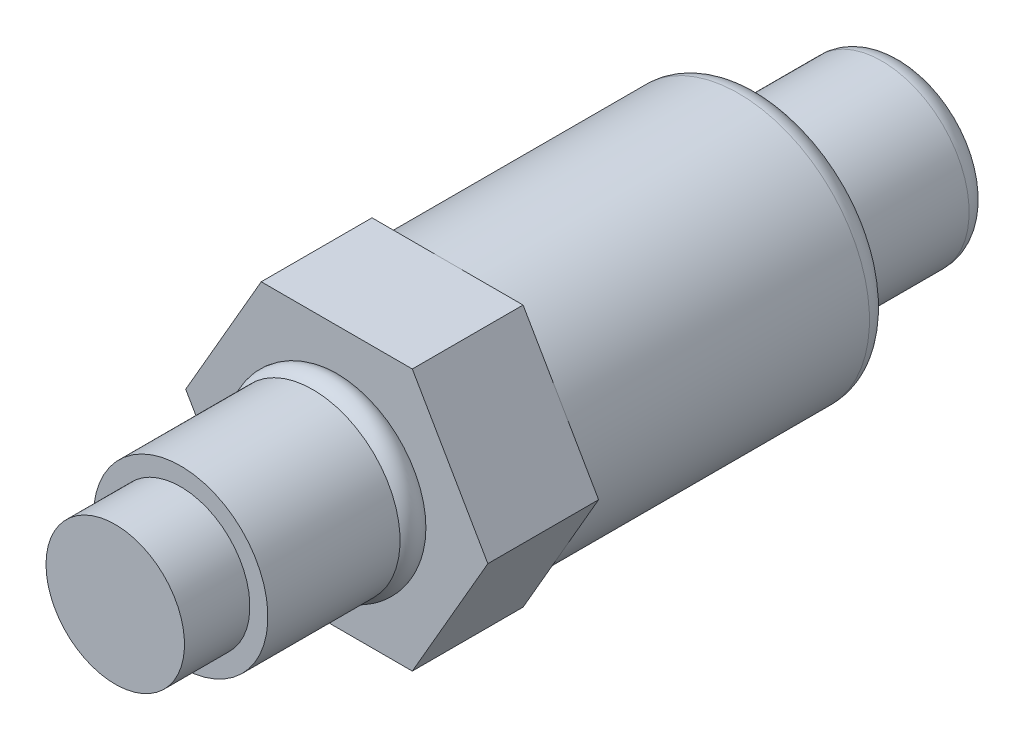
ISO-10303-21;
HEADER;
FILE_DESCRIPTION(('STEP AP214'),'2;1');
FILE_NAME('part.step','',(''),(''),'','','');
FILE_SCHEMA(('AUTOMOTIVE_DESIGN { 1 0 10303 214 1 1 1 1 }'));
ENDSEC;
DATA;
#1=APPLICATION_CONTEXT('core data for automotive mechanical design processes');
#2=APPLICATION_PROTOCOL_DEFINITION('international standard','automotive_design',2000,#1);
#3=PRODUCT_CONTEXT('',#1,'mechanical');
#4=PRODUCT('Part','Part','',(#3));
#5=PRODUCT_RELATED_PRODUCT_CATEGORY('part','',(#4));
#6=PRODUCT_DEFINITION_FORMATION('','',#4);
#7=PRODUCT_DEFINITION_CONTEXT('part definition',#1,'design');
#8=PRODUCT_DEFINITION('design','',#6,#7);
#9=PRODUCT_DEFINITION_SHAPE('','',#8);
#10=(LENGTH_UNIT() NAMED_UNIT(*) SI_UNIT(.MILLI.,.METRE.));
#11=(NAMED_UNIT(*) PLANE_ANGLE_UNIT() SI_UNIT($,.RADIAN.));
#12=(NAMED_UNIT(*) SI_UNIT($,.STERADIAN.) SOLID_ANGLE_UNIT());
#13=UNCERTAINTY_MEASURE_WITH_UNIT(LENGTH_MEASURE(1.E-05),#10,'distance_accuracy_value','');
#14=(GEOMETRIC_REPRESENTATION_CONTEXT(3) GLOBAL_UNCERTAINTY_ASSIGNED_CONTEXT((#13)) GLOBAL_UNIT_ASSIGNED_CONTEXT((#10,
#11,#12)) REPRESENTATION_CONTEXT('',''));
#15=CARTESIAN_POINT('',(0.,0.,0.));
#16=DIRECTION('',(0.,0.,1.));
#17=DIRECTION('',(1.,0.,0.));
#18=AXIS2_PLACEMENT_3D('',#15,#16,#17);
#19=CARTESIAN_POINT('',(0.,0.,14.35));
#20=DIRECTION('',(0.,0.,1.));
#21=DIRECTION('',(1.,0.,0.));
#22=AXIS2_PLACEMENT_3D('',#19,#20,#21);
#23=PLANE('',#22);
#24=CARTESIAN_POINT('',(0.,0.,14.35));
#25=DIRECTION('',(0.,0.,-1.));
#26=DIRECTION('',(-1.,0.,0.));
#27=AXIS2_PLACEMENT_3D('',#24,#25,#26);
#28=CIRCLE('',#27,6.);
#29=CARTESIAN_POINT('',(-5.19615242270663,3.,14.35));
#30=VERTEX_POINT('',#29);
#31=CARTESIAN_POINT('',(0.,6.,14.35));
#32=VERTEX_POINT('',#31);
#33=EDGE_CURVE('E128',#30,#32,#28,.T.);
#34=ORIENTED_EDGE('',*,*,#33,.F.);
#35=DIRECTION('',(-0.5,-0.866025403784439,0.));
#36=VECTOR('',#35,1.);
#37=CARTESIAN_POINT('',(-3.46410161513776,6.,14.35));
#38=LINE('',#37,#36);
#39=CARTESIAN_POINT('',(-3.46410161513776,6.,14.35));
#40=VERTEX_POINT('',#39);
#41=EDGE_CURVE('E107',#40,#30,#38,.T.);
#42=ORIENTED_EDGE('',*,*,#41,.F.);
#43=DIRECTION('',(-1.,0.,0.));
#44=VECTOR('',#43,1.);
#45=CARTESIAN_POINT('',(3.46410161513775,6.,14.35));
#46=LINE('',#45,#44);
#47=EDGE_CURVE('E129',#32,#40,#46,.T.);
#48=ORIENTED_EDGE('',*,*,#47,.F.);
#49=EDGE_LOOP('',(#34,#42,#48));
#50=FACE_BOUND('',#49,.T.);
#51=ADVANCED_FACE('F33',(#50),#23,.F.);
#52=CARTESIAN_POINT('',(5.19615242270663,3.,14.35));
#53=VERTEX_POINT('',#52);
#54=EDGE_CURVE('E55',#32,#53,#28,.T.);
#55=ORIENTED_EDGE('',*,*,#54,.F.);
#56=CARTESIAN_POINT('',(3.46410161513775,6.,14.35));
#57=VERTEX_POINT('',#56);
#58=EDGE_CURVE('E126',#57,#32,#46,.T.);
#59=ORIENTED_EDGE('',*,*,#58,.F.);
#60=DIRECTION('',(-0.5,0.866025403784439,0.));
#61=VECTOR('',#60,1.);
#62=CARTESIAN_POINT('',(6.92820323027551,0.,14.35));
#63=LINE('',#62,#61);
#64=EDGE_CURVE('E149',#53,#57,#63,.T.);
#65=ORIENTED_EDGE('',*,*,#64,.F.);
#66=EDGE_LOOP('',(#55,#59,#65));
#67=FACE_BOUND('',#66,.T.);
#68=ADVANCED_FACE('F208',(#67),#23,.F.);
#69=CARTESIAN_POINT('',(5.19615242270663,-3.,14.35));
#70=VERTEX_POINT('',#69);
#71=EDGE_CURVE('E48',#53,#70,#28,.T.);
#72=ORIENTED_EDGE('',*,*,#71,.F.);
#73=CARTESIAN_POINT('',(6.92820323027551,0.,14.35));
#74=VERTEX_POINT('',#73);
#75=EDGE_CURVE('E151',#74,#53,#63,.T.);
#76=ORIENTED_EDGE('',*,*,#75,.F.);
#77=DIRECTION('',(0.5,0.866025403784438,0.));
#78=VECTOR('',#77,1.);
#79=CARTESIAN_POINT('',(3.46410161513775,-6.,14.35));
#80=LINE('',#79,#78);
#81=EDGE_CURVE('E150',#70,#74,#80,.T.);
#82=ORIENTED_EDGE('',*,*,#81,.F.);
#83=EDGE_LOOP('',(#72,#76,#82));
#84=FACE_BOUND('',#83,.T.);
#85=ADVANCED_FACE('F213',(#84),#23,.F.);
#86=CARTESIAN_POINT('',(0.,-6.,14.35));
#87=VERTEX_POINT('',#86);
#88=EDGE_CURVE('E140',#70,#87,#28,.T.);
#89=ORIENTED_EDGE('',*,*,#88,.F.);
#90=CARTESIAN_POINT('',(3.46410161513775,-6.,14.35));
#91=VERTEX_POINT('',#90);
#92=EDGE_CURVE('E146',#91,#70,#80,.T.);
#93=ORIENTED_EDGE('',*,*,#92,.F.);
#94=DIRECTION('',(1.,0.,0.));
#95=VECTOR('',#94,1.);
#96=CARTESIAN_POINT('',(-3.46410161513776,-6.,14.35));
#97=LINE('',#96,#95);
#98=EDGE_CURVE('E156',#87,#91,#97,.T.);
#99=ORIENTED_EDGE('',*,*,#98,.F.);
#100=EDGE_LOOP('',(#89,#93,#99));
#101=FACE_BOUND('',#100,.T.);
#102=ADVANCED_FACE('F226',(#101),#23,.F.);
#103=CARTESIAN_POINT('',(-5.19615242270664,-3.,14.35));
#104=VERTEX_POINT('',#103);
#105=EDGE_CURVE('E138',#87,#104,#28,.T.);
#106=ORIENTED_EDGE('',*,*,#105,.F.);
#107=CARTESIAN_POINT('',(-3.46410161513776,-6.,14.35));
#108=VERTEX_POINT('',#107);
#109=EDGE_CURVE('E157',#108,#87,#97,.T.);
#110=ORIENTED_EDGE('',*,*,#109,.F.);
#111=DIRECTION('',(0.5,-0.866025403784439,0.));
#112=VECTOR('',#111,1.);
#113=CARTESIAN_POINT('',(-6.92820323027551,0.,14.35));
#114=LINE('',#113,#112);
#115=EDGE_CURVE('E116',#104,#108,#114,.T.);
#116=ORIENTED_EDGE('',*,*,#115,.F.);
#117=EDGE_LOOP('',(#106,#110,#116));
#118=FACE_BOUND('',#117,.T.);
#119=ADVANCED_FACE('F218',(#118),#23,.F.);
#120=EDGE_CURVE('E122',#104,#30,#28,.T.);
#121=ORIENTED_EDGE('',*,*,#120,.F.);
#122=CARTESIAN_POINT('',(-6.92820323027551,0.,14.35));
#123=VERTEX_POINT('',#122);
#124=EDGE_CURVE('E125',#123,#104,#114,.T.);
#125=ORIENTED_EDGE('',*,*,#124,.F.);
#126=EDGE_CURVE('E111',#30,#123,#38,.T.);
#127=ORIENTED_EDGE('',*,*,#126,.F.);
#128=EDGE_LOOP('',(#121,#125,#127));
#129=FACE_BOUND('',#128,.T.);
#130=ADVANCED_FACE('F120',(#129),#23,.F.);
#131=CARTESIAN_POINT('',(3.46410161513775,-6.,14.35));
#132=DIRECTION('',(0.866025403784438,-0.5,0.));
#133=DIRECTION('',(0.5,0.866025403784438,0.));
#134=AXIS2_PLACEMENT_3D('',#131,#132,#133);
#135=PLANE('',#134);
#136=DIRECTION('',(0.5,0.866025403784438,0.));
#137=VECTOR('',#136,1.);
#138=CARTESIAN_POINT('',(3.46410161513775,-6.,19.43));
#139=LINE('',#138,#137);
#140=CARTESIAN_POINT('',(3.46410161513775,-6.,19.43));
#141=VERTEX_POINT('',#140);
#142=CARTESIAN_POINT('',(6.92820323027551,0.,19.43));
#143=VERTEX_POINT('',#142);
#144=EDGE_CURVE('E132',#141,#143,#139,.T.);
#145=ORIENTED_EDGE('',*,*,#144,.F.);
#146=DIRECTION('',(0.,0.,1.));
#147=VECTOR('',#146,1.);
#148=CARTESIAN_POINT('',(3.46410161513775,-6.,14.35));
#149=LINE('',#148,#147);
#150=EDGE_CURVE('E139',#91,#141,#149,.T.);
#151=ORIENTED_EDGE('',*,*,#150,.F.);
#152=ORIENTED_EDGE('',*,*,#92,.T.);
#153=ORIENTED_EDGE('',*,*,#81,.T.);
#154=DIRECTION('',(0.,0.,1.));
#155=VECTOR('',#154,1.);
#156=CARTESIAN_POINT('',(6.92820323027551,0.,14.35));
#157=LINE('',#156,#155);
#158=EDGE_CURVE('E160',#74,#143,#157,.T.);
#159=ORIENTED_EDGE('',*,*,#158,.T.);
#160=EDGE_LOOP('',(#145,#151,#152,#153,#159));
#161=FACE_BOUND('',#160,.T.);
#162=ADVANCED_FACE('F217',(#161),#135,.T.);
#163=CARTESIAN_POINT('',(-3.46410161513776,-6.,14.35));
#164=DIRECTION('',(0.,-1.,0.));
#165=DIRECTION('',(1.,0.,0.));
#166=AXIS2_PLACEMENT_3D('',#163,#164,#165);
#167=PLANE('',#166);
#168=DIRECTION('',(1.,0.,0.));
#169=VECTOR('',#168,1.);
#170=CARTESIAN_POINT('',(-3.46410161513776,-6.,19.43));
#171=LINE('',#170,#169);
#172=CARTESIAN_POINT('',(-3.46410161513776,-6.,19.43));
#173=VERTEX_POINT('',#172);
#174=EDGE_CURVE('E175',#173,#141,#171,.T.);
#175=ORIENTED_EDGE('',*,*,#174,.F.);
#176=DIRECTION('',(0.,0.,1.));
#177=VECTOR('',#176,1.);
#178=CARTESIAN_POINT('',(-3.46410161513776,-6.,14.35));
#179=LINE('',#178,#177);
#180=EDGE_CURVE('E141',#108,#173,#179,.T.);
#181=ORIENTED_EDGE('',*,*,#180,.F.);
#182=ORIENTED_EDGE('',*,*,#109,.T.);
#183=ORIENTED_EDGE('',*,*,#98,.T.);
#184=ORIENTED_EDGE('',*,*,#150,.T.);
#185=EDGE_LOOP('',(#175,#181,#182,#183,#184));
#186=FACE_BOUND('',#185,.T.);
#187=ADVANCED_FACE('F223',(#186),#167,.T.);
#188=CARTESIAN_POINT('',(-6.92820323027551,0.,14.35));
#189=DIRECTION('',(-0.866025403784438,-0.5,0.));
#190=DIRECTION('',(0.5,-0.866025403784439,0.));
#191=AXIS2_PLACEMENT_3D('',#188,#189,#190);
#192=PLANE('',#191);
#193=DIRECTION('',(0.5,-0.866025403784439,0.));
#194=VECTOR('',#193,1.);
#195=CARTESIAN_POINT('',(-6.92820323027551,0.,19.43));
#196=LINE('',#195,#194);
#197=CARTESIAN_POINT('',(-6.92820323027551,0.,19.43));
#198=VERTEX_POINT('',#197);
#199=EDGE_CURVE('E172',#198,#173,#196,.T.);
#200=ORIENTED_EDGE('',*,*,#199,.F.);
#201=DIRECTION('',(0.,0.,1.));
#202=VECTOR('',#201,1.);
#203=CARTESIAN_POINT('',(-6.92820323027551,0.,14.35));
#204=LINE('',#203,#202);
#205=EDGE_CURVE('E179',#123,#198,#204,.T.);
#206=ORIENTED_EDGE('',*,*,#205,.F.);
#207=ORIENTED_EDGE('',*,*,#124,.T.);
#208=ORIENTED_EDGE('',*,*,#115,.T.);
#209=ORIENTED_EDGE('',*,*,#180,.T.);
#210=EDGE_LOOP('',(#200,#206,#207,#208,#209));
#211=FACE_BOUND('',#210,.T.);
#212=ADVANCED_FACE('F241',(#211),#192,.T.);
#213=CARTESIAN_POINT('',(-3.46410161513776,6.,14.35));
#214=DIRECTION('',(-0.866025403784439,0.5,0.));
#215=DIRECTION('',(-0.5,-0.866025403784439,0.));
#216=AXIS2_PLACEMENT_3D('',#213,#214,#215);
#217=PLANE('',#216);
#218=DIRECTION('',(-0.5,-0.866025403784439,0.));
#219=VECTOR('',#218,1.);
#220=CARTESIAN_POINT('',(-3.46410161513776,6.,19.43));
#221=LINE('',#220,#219);
#222=CARTESIAN_POINT('',(-3.46410161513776,6.,19.43));
#223=VERTEX_POINT('',#222);
#224=EDGE_CURVE('E169',#223,#198,#221,.T.);
#225=ORIENTED_EDGE('',*,*,#224,.F.);
#226=DIRECTION('',(0.,0.,1.));
#227=VECTOR('',#226,1.);
#228=CARTESIAN_POINT('',(-3.46410161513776,6.,14.35));
#229=LINE('',#228,#227);
#230=EDGE_CURVE('E113',#40,#223,#229,.T.);
#231=ORIENTED_EDGE('',*,*,#230,.F.);
#232=ORIENTED_EDGE('',*,*,#41,.T.);
#233=ORIENTED_EDGE('',*,*,#126,.T.);
#234=ORIENTED_EDGE('',*,*,#205,.T.);
#235=EDGE_LOOP('',(#225,#231,#232,#233,#234));
#236=FACE_BOUND('',#235,.T.);
#237=ADVANCED_FACE('F110',(#236),#217,.T.);
#238=CARTESIAN_POINT('',(3.46410161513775,6.,14.35));
#239=DIRECTION('',(0.,1.,0.));
#240=DIRECTION('',(-1.,0.,0.));
#241=AXIS2_PLACEMENT_3D('',#238,#239,#240);
#242=PLANE('',#241);
#243=DIRECTION('',(-1.,0.,0.));
#244=VECTOR('',#243,1.);
#245=CARTESIAN_POINT('',(3.46410161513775,6.,19.43));
#246=LINE('',#245,#244);
#247=CARTESIAN_POINT('',(3.46410161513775,6.,19.43));
#248=VERTEX_POINT('',#247);
#249=EDGE_CURVE('E166',#248,#223,#246,.T.);
#250=ORIENTED_EDGE('',*,*,#249,.F.);
#251=DIRECTION('',(0.,0.,1.));
#252=VECTOR('',#251,1.);
#253=CARTESIAN_POINT('',(3.46410161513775,6.,14.35));
#254=LINE('',#253,#252);
#255=EDGE_CURVE('E182',#57,#248,#254,.T.);
#256=ORIENTED_EDGE('',*,*,#255,.F.);
#257=ORIENTED_EDGE('',*,*,#58,.T.);
#258=ORIENTED_EDGE('',*,*,#47,.T.);
#259=ORIENTED_EDGE('',*,*,#230,.T.);
#260=EDGE_LOOP('',(#250,#256,#257,#258,#259));
#261=FACE_BOUND('',#260,.T.);
#262=ADVANCED_FACE('F248',(#261),#242,.T.);
#263=CARTESIAN_POINT('',(6.92820323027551,0.,14.35));
#264=DIRECTION('',(0.866025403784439,0.5,0.));
#265=DIRECTION('',(-0.5,0.866025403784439,0.));
#266=AXIS2_PLACEMENT_3D('',#263,#264,#265);
#267=PLANE('',#266);
#268=DIRECTION('',(-0.5,0.866025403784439,0.));
#269=VECTOR('',#268,1.);
#270=CARTESIAN_POINT('',(6.92820323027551,0.,19.43));
#271=LINE('',#270,#269);
#272=EDGE_CURVE('E163',#143,#248,#271,.T.);
#273=ORIENTED_EDGE('',*,*,#272,.F.);
#274=ORIENTED_EDGE('',*,*,#158,.F.);
#275=ORIENTED_EDGE('',*,*,#75,.T.);
#276=ORIENTED_EDGE('',*,*,#64,.T.);
#277=ORIENTED_EDGE('',*,*,#255,.T.);
#278=EDGE_LOOP('',(#273,#274,#275,#276,#277));
#279=FACE_BOUND('',#278,.T.);
#280=ADVANCED_FACE('F251',(#279),#267,.T.);
#281=CARTESIAN_POINT('',(0.,0.,19.43));
#282=DIRECTION('',(0.,0.,1.));
#283=DIRECTION('',(1.,0.,0.));
#284=AXIS2_PLACEMENT_3D('',#281,#282,#283);
#285=PLANE('',#284);
#286=CARTESIAN_POINT('',(0.,0.,19.43));
#287=DIRECTION('',(0.,0.,1.));
#288=DIRECTION('',(1.,0.,0.));
#289=AXIS2_PLACEMENT_3D('',#286,#287,#288);
#290=CIRCLE('',#289,4.08860313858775);
#291=CARTESIAN_POINT('',(4.08860313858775,0.,19.43));
#292=VERTEX_POINT('',#291);
#293=EDGE_CURVE('E185',#292,#292,#290,.T.);
#294=ORIENTED_EDGE('',*,*,#293,.F.);
#295=EDGE_LOOP('',(#294));
#296=FACE_BOUND('',#295,.T.);
#297=ORIENTED_EDGE('',*,*,#144,.T.);
#298=ORIENTED_EDGE('',*,*,#272,.T.);
#299=ORIENTED_EDGE('',*,*,#249,.T.);
#300=ORIENTED_EDGE('',*,*,#224,.T.);
#301=ORIENTED_EDGE('',*,*,#199,.T.);
#302=ORIENTED_EDGE('',*,*,#174,.T.);
#303=EDGE_LOOP('',(#297,#298,#299,#300,#301,#302));
#304=FACE_BOUND('',#303,.T.);
#305=ADVANCED_FACE('F243',(#296,#304),#285,.T.);
#306=CARTESIAN_POINT('',(0.,0.,14.35));
#307=DIRECTION('',(0.,0.,-1.));
#308=DIRECTION('',(-1.,0.,0.));
#309=AXIS2_PLACEMENT_3D('',#306,#307,#308);
#310=CYLINDRICAL_SURFACE('',#309,6.);
#311=CARTESIAN_POINT('',(0.,0.,0.999999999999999));
#312=DIRECTION('',(0.,0.,-1.));
#313=DIRECTION('',(-1.,0.,0.));
#314=AXIS2_PLACEMENT_3D('',#311,#312,#313);
#315=CIRCLE('',#314,6.);
#316=CARTESIAN_POINT('',(-6.,0.,0.999999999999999));
#317=VERTEX_POINT('',#316);
#318=EDGE_CURVE('E191',#317,#317,#315,.F.);
#319=ORIENTED_EDGE('',*,*,#318,.T.);
#320=EDGE_LOOP('',(#319));
#321=FACE_BOUND('',#320,.T.);
#322=ORIENTED_EDGE('',*,*,#33,.T.);
#323=ORIENTED_EDGE('',*,*,#54,.T.);
#324=ORIENTED_EDGE('',*,*,#71,.T.);
#325=ORIENTED_EDGE('',*,*,#88,.T.);
#326=ORIENTED_EDGE('',*,*,#105,.T.);
#327=ORIENTED_EDGE('',*,*,#120,.T.);
#328=EDGE_LOOP('',(#322,#323,#324,#325,#326,#327));
#329=FACE_BOUND('',#328,.T.);
#330=ADVANCED_FACE('F136',(#321,#329),#310,.T.);
#331=CARTESIAN_POINT('',(0.,0.,-6.57));
#332=DIRECTION('',(0.,0.,-1.));
#333=DIRECTION('',(-1.,0.,0.));
#334=AXIS2_PLACEMENT_3D('',#331,#332,#333);
#335=PLANE('',#334);
#336=CARTESIAN_POINT('',(0.,0.,-6.57));
#337=DIRECTION('',(0.,0.,-1.));
#338=DIRECTION('',(-1.,0.,0.));
#339=AXIS2_PLACEMENT_3D('',#336,#337,#338);
#340=CIRCLE('',#339,3.);
#341=CARTESIAN_POINT('',(-3.,0.,-6.57));
#342=VERTEX_POINT('',#341);
#343=EDGE_CURVE('E41',#342,#342,#340,.T.);
#344=ORIENTED_EDGE('',*,*,#343,.T.);
#345=EDGE_LOOP('',(#344));
#346=FACE_BOUND('',#345,.T.);
#347=ADVANCED_FACE('F196',(#346),#335,.T.);
#348=CARTESIAN_POINT('',(0.,0.,14.35));
#349=DIRECTION('',(0.,0.,-1.));
#350=DIRECTION('',(-1.,0.,0.));
#351=AXIS2_PLACEMENT_3D('',#348,#349,#350);
#352=CYLINDRICAL_SURFACE('',#351,4.);
#353=CARTESIAN_POINT('',(0.,0.,-5.57));
#354=DIRECTION('',(0.,0.,-1.));
#355=DIRECTION('',(-1.,0.,0.));
#356=AXIS2_PLACEMENT_3D('',#353,#354,#355);
#357=CIRCLE('',#356,4.);
#358=CARTESIAN_POINT('',(-4.,0.,-5.57));
#359=VERTEX_POINT('',#358);
#360=EDGE_CURVE('E11',#359,#359,#357,.F.);
#361=ORIENTED_EDGE('',*,*,#360,.T.);
#362=EDGE_LOOP('',(#361));
#363=FACE_BOUND('',#362,.T.);
#364=CARTESIAN_POINT('',(0.,0.,0.));
#365=DIRECTION('',(0.,0.,-1.));
#366=DIRECTION('',(-1.,0.,0.));
#367=AXIS2_PLACEMENT_3D('',#364,#365,#366);
#368=CIRCLE('',#367,4.);
#369=CARTESIAN_POINT('',(-4.,0.,0.));
#370=VERTEX_POINT('',#369);
#371=EDGE_CURVE('E133',#370,#370,#368,.T.);
#372=ORIENTED_EDGE('',*,*,#371,.T.);
#373=EDGE_LOOP('',(#372));
#374=FACE_BOUND('',#373,.T.);
#375=ADVANCED_FACE('F395',(#363,#374),#352,.T.);
#376=CARTESIAN_POINT('',(4.,0.,0.));
#377=DIRECTION('',(0.,0.,-1.));
#378=DIRECTION('',(-1.,0.,0.));
#379=AXIS2_PLACEMENT_3D('',#376,#377,#378);
#380=PLANE('',#379);
#381=CARTESIAN_POINT('',(0.,0.,0.));
#382=DIRECTION('',(0.,0.,-1.));
#383=DIRECTION('',(-1.,0.,0.));
#384=AXIS2_PLACEMENT_3D('',#381,#382,#383);
#385=CIRCLE('',#384,5.);
#386=CARTESIAN_POINT('',(-5.,0.,0.));
#387=VERTEX_POINT('',#386);
#388=EDGE_CURVE('E188',#387,#387,#385,.T.);
#389=ORIENTED_EDGE('',*,*,#388,.T.);
#390=EDGE_LOOP('',(#389));
#391=FACE_BOUND('',#390,.T.);
#392=ORIENTED_EDGE('',*,*,#371,.F.);
#393=EDGE_LOOP('',(#392));
#394=FACE_BOUND('',#393,.T.);
#395=ADVANCED_FACE('F336',(#391,#394),#380,.T.);
#396=CARTESIAN_POINT('',(0.,0.,29.59));
#397=DIRECTION('',(0.,0.,-1.));
#398=DIRECTION('',(-1.,0.,0.));
#399=AXIS2_PLACEMENT_3D('',#396,#397,#398);
#400=CYLINDRICAL_SURFACE('',#399,3.175);
#401=CARTESIAN_POINT('',(0.,0.,29.59));
#402=DIRECTION('',(0.,0.,-1.));
#403=DIRECTION('',(-1.,0.,0.));
#404=AXIS2_PLACEMENT_3D('',#401,#402,#403);
#405=CIRCLE('',#404,3.175);
#406=CARTESIAN_POINT('',(-3.175,0.,29.59));
#407=VERTEX_POINT('',#406);
#408=EDGE_CURVE('E429',#407,#407,#405,.T.);
#409=ORIENTED_EDGE('',*,*,#408,.T.);
#410=EDGE_LOOP('',(#409));
#411=FACE_BOUND('',#410,.T.);
#412=CARTESIAN_POINT('',(0.,0.,26.59));
#413=DIRECTION('',(0.,0.,-1.));
#414=DIRECTION('',(-1.,0.,0.));
#415=AXIS2_PLACEMENT_3D('',#412,#413,#414);
#416=CIRCLE('',#415,3.175);
#417=CARTESIAN_POINT('',(-3.175,0.,26.59));
#418=VERTEX_POINT('',#417);
#419=EDGE_CURVE('E439',#418,#418,#416,.T.);
#420=ORIENTED_EDGE('',*,*,#419,.F.);
#421=EDGE_LOOP('',(#420));
#422=FACE_BOUND('',#421,.T.);
#423=ADVANCED_FACE('F330',(#411,#422),#400,.T.);
#424=CARTESIAN_POINT('',(3.175,0.,29.59));
#425=DIRECTION('',(0.,0.,1.));
#426=DIRECTION('',(1.,0.,0.));
#427=AXIS2_PLACEMENT_3D('',#424,#425,#426);
#428=PLANE('',#427);
#429=ORIENTED_EDGE('',*,*,#408,.F.);
#430=EDGE_LOOP('',(#429));
#431=FACE_BOUND('',#430,.T.);
#432=ADVANCED_FACE('F335',(#431),#428,.T.);
#433=CARTESIAN_POINT('',(0.,0.,19.93));
#434=DIRECTION('',(0.,0.,-1.));
#435=DIRECTION('',(-1.,0.,0.));
#436=AXIS2_PLACEMENT_3D('',#433,#434,#435);
#437=TOROIDAL_SURFACE('',#436,3.445,0.815000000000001);
#438=CARTESIAN_POINT('',(0.,0.,20.5268249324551));
#439=DIRECTION('',(0.,0.,-1.));
#440=DIRECTION('',(-1.,0.,0.));
#441=AXIS2_PLACEMENT_3D('',#438,#439,#440);
#442=CIRCLE('',#441,3.99999999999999);
#443=CARTESIAN_POINT('',(-3.99999999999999,0.,20.5268249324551));
#444=VERTEX_POINT('',#443);
#445=EDGE_CURVE('E431',#444,#444,#442,.T.);
#446=ORIENTED_EDGE('',*,*,#445,.T.);
#447=EDGE_LOOP('',(#446));
#448=FACE_BOUND('',#447,.T.);
#449=ORIENTED_EDGE('',*,*,#293,.T.);
#450=EDGE_LOOP('',(#449));
#451=FACE_BOUND('',#450,.T.);
#452=ADVANCED_FACE('F348',(#448,#451),#437,.T.);
#453=CARTESIAN_POINT('',(0.,0.,29.59));
#454=DIRECTION('',(0.,0.,-1.));
#455=DIRECTION('',(-1.,0.,0.));
#456=AXIS2_PLACEMENT_3D('',#453,#454,#455);
#457=CYLINDRICAL_SURFACE('',#456,3.99999999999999);
#458=CARTESIAN_POINT('',(0.,0.,26.59));
#459=DIRECTION('',(0.,0.,-1.));
#460=DIRECTION('',(-1.,0.,0.));
#461=AXIS2_PLACEMENT_3D('',#458,#459,#460);
#462=CIRCLE('',#461,4.);
#463=CARTESIAN_POINT('',(-4.,0.,26.59));
#464=VERTEX_POINT('',#463);
#465=EDGE_CURVE('E434',#464,#464,#462,.T.);
#466=ORIENTED_EDGE('',*,*,#465,.T.);
#467=EDGE_LOOP('',(#466));
#468=FACE_BOUND('',#467,.T.);
#469=ORIENTED_EDGE('',*,*,#445,.F.);
#470=EDGE_LOOP('',(#469));
#471=FACE_BOUND('',#470,.T.);
#472=ADVANCED_FACE('F358',(#468,#471),#457,.T.);
#473=CARTESIAN_POINT('',(4.,0.,26.59));
#474=DIRECTION('',(0.,0.,1.));
#475=DIRECTION('',(1.,0.,0.));
#476=AXIS2_PLACEMENT_3D('',#473,#474,#475);
#477=PLANE('',#476);
#478=ORIENTED_EDGE('',*,*,#419,.T.);
#479=EDGE_LOOP('',(#478));
#480=FACE_BOUND('',#479,.T.);
#481=ORIENTED_EDGE('',*,*,#465,.F.);
#482=EDGE_LOOP('',(#481));
#483=FACE_BOUND('',#482,.T.);
#484=ADVANCED_FACE('F204',(#480,#483),#477,.T.);
#485=CARTESIAN_POINT('',(0.,0.,0.999999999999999));
#486=DIRECTION('',(0.,0.,-1.));
#487=DIRECTION('',(-1.,0.,0.));
#488=AXIS2_PLACEMENT_3D('',#485,#486,#487);
#489=TOROIDAL_SURFACE('',#488,5.,1.);
#490=ORIENTED_EDGE('',*,*,#318,.F.);
#491=EDGE_LOOP('',(#490));
#492=FACE_BOUND('',#491,.T.);
#493=ORIENTED_EDGE('',*,*,#388,.F.);
#494=EDGE_LOOP('',(#493));
#495=FACE_BOUND('',#494,.T.);
#496=ADVANCED_FACE('F199',(#492,#495),#489,.T.);
#497=CARTESIAN_POINT('',(0.,0.,-5.57));
#498=DIRECTION('',(0.,0.,-1.));
#499=DIRECTION('',(-1.,0.,0.));
#500=AXIS2_PLACEMENT_3D('',#497,#498,#499);
#501=TOROIDAL_SURFACE('',#500,3.,1.);
#502=ORIENTED_EDGE('',*,*,#360,.F.);
#503=EDGE_LOOP('',(#502));
#504=FACE_BOUND('',#503,.T.);
#505=ORIENTED_EDGE('',*,*,#343,.F.);
#506=EDGE_LOOP('',(#505));
#507=FACE_BOUND('',#506,.T.);
#508=ADVANCED_FACE('F35',(#504,#507),#501,.T.);
#509=CLOSED_SHELL('',(#51,#68,#85,#102,#119,#130,#162,#187,#212,#237,#262,#280,#305,#330,#347,
#375,#395,#423,#432,#452,#472,#484,#496,#508));
#510=MANIFOLD_SOLID_BREP('B2',#509);
#511=ADVANCED_BREP_SHAPE_REPRESENTATION('',(#18,#510),#14);
#512=SHAPE_DEFINITION_REPRESENTATION(#9,#511);
ENDSEC;
END-ISO-10303-21;
